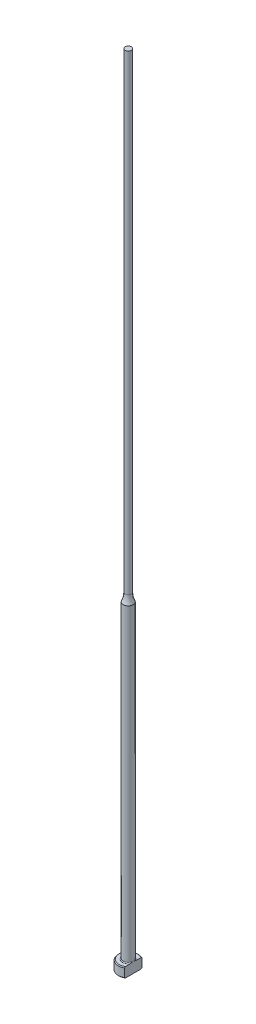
ISO-10303-21;
HEADER;
FILE_DESCRIPTION(('STEP AP214'),'2;1');
FILE_NAME('part.step','',(''),(''),'','','');
FILE_SCHEMA(('AUTOMOTIVE_DESIGN { 1 0 10303 214 1 1 1 1 }'));
ENDSEC;
DATA;
#1=APPLICATION_CONTEXT('core data for automotive mechanical design processes');
#2=APPLICATION_PROTOCOL_DEFINITION('international standard','automotive_design',2000,#1);
#3=PRODUCT_CONTEXT('',#1,'mechanical');
#4=PRODUCT('Part','Part','',(#3));
#5=PRODUCT_RELATED_PRODUCT_CATEGORY('part','',(#4));
#6=PRODUCT_DEFINITION_FORMATION('','',#4);
#7=PRODUCT_DEFINITION_CONTEXT('part definition',#1,'design');
#8=PRODUCT_DEFINITION('design','',#6,#7);
#9=PRODUCT_DEFINITION_SHAPE('','',#8);
#10=(LENGTH_UNIT() NAMED_UNIT(*) SI_UNIT(.MILLI.,.METRE.));
#11=(NAMED_UNIT(*) PLANE_ANGLE_UNIT() SI_UNIT($,.RADIAN.));
#12=(NAMED_UNIT(*) SI_UNIT($,.STERADIAN.) SOLID_ANGLE_UNIT());
#13=UNCERTAINTY_MEASURE_WITH_UNIT(LENGTH_MEASURE(1.E-05),#10,'distance_accuracy_value','');
#14=(GEOMETRIC_REPRESENTATION_CONTEXT(3) GLOBAL_UNCERTAINTY_ASSIGNED_CONTEXT((#13)) GLOBAL_UNIT_ASSIGNED_CONTEXT((#10,
#11,#12)) REPRESENTATION_CONTEXT('',''));
#15=CARTESIAN_POINT('',(0.,0.,0.));
#16=DIRECTION('',(0.,0.,1.));
#17=DIRECTION('',(1.,0.,0.));
#18=AXIS2_PLACEMENT_3D('',#15,#16,#17);
#19=CARTESIAN_POINT('',(-3.17499999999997,3.175,0.));
#20=DIRECTION('',(0.,1.,0.));
#21=DIRECTION('',(0.,0.,1.));
#22=AXIS2_PLACEMENT_3D('',#19,#20,#21);
#23=PLANE('',#22);
#24=CARTESIAN_POINT('',(0.,3.175,0.));
#25=DIRECTION('',(0.,1.,0.));
#26=DIRECTION('',(0.,0.,1.));
#27=AXIS2_PLACEMENT_3D('',#24,#25,#26);
#28=CIRCLE('',#27,2.92099999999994);
#29=CARTESIAN_POINT('',(1.58749999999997,3.175,-2.45195529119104));
#30=VERTEX_POINT('',#29);
#31=CARTESIAN_POINT('',(1.58749999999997,3.175,2.45195529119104));
#32=VERTEX_POINT('',#31);
#33=EDGE_CURVE('E105',#30,#32,#28,.T.);
#34=ORIENTED_EDGE('',*,*,#33,.T.);
#35=DIRECTION('',(0.,0.,1.));
#36=VECTOR('',#35,1.);
#37=CARTESIAN_POINT('',(1.58749999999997,3.17499999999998,2.74963065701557));
#38=LINE('',#37,#36);
#39=CARTESIAN_POINT('',(1.58749999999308,3.175,0.933255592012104));
#40=VERTEX_POINT('',#39);
#41=EDGE_CURVE('E126',#40,#32,#38,.T.);
#42=ORIENTED_EDGE('',*,*,#41,.F.);
#43=CARTESIAN_POINT('',(0.,3.175,0.));
#44=DIRECTION('',(0.,1.,0.));
#45=DIRECTION('',(0.,0.,1.));
#46=AXIS2_PLACEMENT_3D('',#43,#44,#45);
#47=CIRCLE('',#46,1.84149999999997);
#48=CARTESIAN_POINT('',(1.58749999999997,3.17500000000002,-0.933255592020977));
#49=VERTEX_POINT('',#48);
#50=EDGE_CURVE('E11',#40,#49,#47,.F.);
#51=ORIENTED_EDGE('',*,*,#50,.T.);
#52=EDGE_CURVE('E52',#30,#49,#38,.T.);
#53=ORIENTED_EDGE('',*,*,#52,.F.);
#54=EDGE_LOOP('',(#34,#42,#51,#53));
#55=FACE_BOUND('',#54,.T.);
#56=ADVANCED_FACE('F32',(#55),#23,.T.);
#57=CARTESIAN_POINT('',(0.,259.958771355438,0.));
#58=DIRECTION('',(0.,1.,0.));
#59=DIRECTION('',(0.,0.,1.));
#60=AXIS2_PLACEMENT_3D('',#57,#58,#59);
#61=CYLINDRICAL_SURFACE('',#60,3.17499999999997);
#62=CARTESIAN_POINT('',(0.,2.92100000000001,0.));
#63=DIRECTION('',(0.,1.,0.));
#64=DIRECTION('',(0.,0.,1.));
#65=AXIS2_PLACEMENT_3D('',#62,#63,#64);
#66=CIRCLE('',#65,3.17499999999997);
#67=CARTESIAN_POINT('',(1.58749999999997,2.92100000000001,2.74963065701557));
#68=VERTEX_POINT('',#67);
#69=CARTESIAN_POINT('',(1.58749999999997,2.92100000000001,-2.74963065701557));
#70=VERTEX_POINT('',#69);
#71=EDGE_CURVE('E98',#68,#70,#66,.F.);
#72=ORIENTED_EDGE('',*,*,#71,.T.);
#73=DIRECTION('',(0.,-1.,0.));
#74=VECTOR('',#73,1.);
#75=CARTESIAN_POINT('',(1.58749999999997,254.001,-2.74963065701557));
#76=LINE('',#75,#74);
#77=CARTESIAN_POINT('',(1.58749999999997,0.253999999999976,-2.74963065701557));
#78=VERTEX_POINT('',#77);
#79=EDGE_CURVE('E141',#70,#78,#76,.T.);
#80=ORIENTED_EDGE('',*,*,#79,.T.);
#81=CARTESIAN_POINT('',(0.,0.253999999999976,0.));
#82=DIRECTION('',(0.,-1.,0.));
#83=DIRECTION('',(0.,0.,-1.));
#84=AXIS2_PLACEMENT_3D('',#81,#82,#83);
#85=CIRCLE('',#84,3.17499999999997);
#86=CARTESIAN_POINT('',(1.58749999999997,0.253999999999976,2.74963065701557));
#87=VERTEX_POINT('',#86);
#88=EDGE_CURVE('E95',#78,#87,#85,.F.);
#89=ORIENTED_EDGE('',*,*,#88,.T.);
#90=DIRECTION('',(0.,-1.,0.));
#91=VECTOR('',#90,1.);
#92=CARTESIAN_POINT('',(1.58749999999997,254.001,2.74963065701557));
#93=LINE('',#92,#91);
#94=EDGE_CURVE('E88',#68,#87,#93,.T.);
#95=ORIENTED_EDGE('',*,*,#94,.F.);
#96=EDGE_LOOP('',(#72,#80,#89,#95));
#97=FACE_BOUND('',#96,.T.);
#98=ADVANCED_FACE('F191',(#97),#61,.T.);
#99=CARTESIAN_POINT('',(0.,0.,0.));
#100=DIRECTION('',(0.,-1.,0.));
#101=DIRECTION('',(0.,0.,-1.));
#102=AXIS2_PLACEMENT_3D('',#99,#100,#101);
#103=PLANE('',#102);
#104=CARTESIAN_POINT('',(0.,0.,0.));
#105=DIRECTION('',(0.,-1.,0.));
#106=DIRECTION('',(0.,0.,-1.));
#107=AXIS2_PLACEMENT_3D('',#104,#105,#106);
#108=CIRCLE('',#107,2.92100000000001);
#109=CARTESIAN_POINT('',(1.58749999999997,0.,2.45195529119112));
#110=VERTEX_POINT('',#109);
#111=CARTESIAN_POINT('',(1.58749999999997,0.,-2.45195529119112));
#112=VERTEX_POINT('',#111);
#113=EDGE_CURVE('E93',#110,#112,#108,.T.);
#114=ORIENTED_EDGE('',*,*,#113,.T.);
#115=DIRECTION('',(0.,0.,1.));
#116=VECTOR('',#115,1.);
#117=CARTESIAN_POINT('',(1.58749999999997,0.,2.74963065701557));
#118=LINE('',#117,#116);
#119=EDGE_CURVE('E78',#112,#110,#118,.T.);
#120=ORIENTED_EDGE('',*,*,#119,.T.);
#121=EDGE_LOOP('',(#114,#120));
#122=FACE_BOUND('',#121,.T.);
#123=ADVANCED_FACE('F97',(#122),#103,.T.);
#124=CARTESIAN_POINT('',(0.,3.17499999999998,0.));
#125=DIRECTION('',(0.,-1.,0.));
#126=DIRECTION('',(0.,0.,-1.));
#127=AXIS2_PLACEMENT_3D('',#124,#125,#126);
#128=CONICAL_SURFACE('',#127,2.92099999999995,0.785398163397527);
#129=ORIENTED_EDGE('',*,*,#71,.F.);
#130=CARTESIAN_POINT('',(1.58749999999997,-0.16162066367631,-6.0529050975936));
#131=CARTESIAN_POINT('',(1.58749999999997,-0.0288893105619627,-5.91567682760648));
#132=CARTESIAN_POINT('',(1.58749999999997,0.103699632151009,-5.7783103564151));
#133=CARTESIAN_POINT('',(1.58749999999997,0.368508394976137,-5.50321874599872));
#134=CARTESIAN_POINT('',(1.58749999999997,0.500728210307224,-5.36549360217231));
#135=CARTESIAN_POINT('',(1.58749999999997,0.764778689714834,-5.08953516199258));
#136=CARTESIAN_POINT('',(1.58749999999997,0.896609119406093,-4.9513016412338));
#137=CARTESIAN_POINT('',(1.58749999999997,1.15968706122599,-4.67428233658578));
#138=CARTESIAN_POINT('',(1.58749999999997,1.29093457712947,-4.53549655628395));
#139=CARTESIAN_POINT('',(1.58749999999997,1.55007705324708,-4.25997724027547));
#140=CARTESIAN_POINT('',(1.58749999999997,1.67798684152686,-4.12325766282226));
#141=CARTESIAN_POINT('',(1.58749999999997,1.9328486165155,-3.84892898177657));
#142=CARTESIAN_POINT('',(1.58749999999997,2.05980060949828,-3.71131988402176));
#143=CARTESIAN_POINT('',(1.58749999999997,2.31237508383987,-3.43493978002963));
#144=CARTESIAN_POINT('',(1.58749999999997,2.43799784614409,-3.29616903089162));
#145=CARTESIAN_POINT('',(1.58749999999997,2.68741369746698,-3.01699558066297));
#146=CARTESIAN_POINT('',(1.58749999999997,2.81120686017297,-2.8765929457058));
#147=CARTESIAN_POINT('',(1.58749999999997,3.00875865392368,-2.64816703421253));
#148=CARTESIAN_POINT('',(1.58749999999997,3.08336151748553,-2.56087478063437));
#149=CARTESIAN_POINT('',(1.58749999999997,3.2312387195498,-2.38515423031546));
#150=CARTESIAN_POINT('',(1.58749999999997,3.30451292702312,-2.29672582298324));
#151=CARTESIAN_POINT('',(1.58749999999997,3.45004422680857,-2.1174740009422));
#152=CARTESIAN_POINT('',(1.58749999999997,3.5222823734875,-2.02663514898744));
#153=CARTESIAN_POINT('',(1.58749999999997,3.66423097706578,-1.8430252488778));
#154=CARTESIAN_POINT('',(1.58749999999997,3.73394203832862,-1.75025467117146));
#155=CARTESIAN_POINT('',(1.58749999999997,3.87080633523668,-1.5606747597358));
#156=CARTESIAN_POINT('',(1.58749999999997,3.93790459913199,-1.46382547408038));
#157=CARTESIAN_POINT('',(1.58749999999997,4.06669147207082,-1.26632594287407));
#158=CARTESIAN_POINT('',(1.58749999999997,4.1283726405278,-1.16567073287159));
#159=CARTESIAN_POINT('',(1.58749999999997,4.21402252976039,-1.01165766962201));
#160=CARTESIAN_POINT('',(1.58749999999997,4.24127929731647,-0.960142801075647));
#161=CARTESIAN_POINT('',(1.58749999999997,4.2930979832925,-0.855780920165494));
#162=CARTESIAN_POINT('',(1.58749999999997,4.31765941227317,-0.802933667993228));
#163=CARTESIAN_POINT('',(1.58749999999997,4.38614656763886,-0.642461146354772));
#164=CARTESIAN_POINT('',(1.58749999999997,4.42510149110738,-0.532518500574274));
#165=CARTESIAN_POINT('',(1.58749999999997,4.46726244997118,-0.367680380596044));
#166=CARTESIAN_POINT('',(1.58749999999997,4.47844427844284,-0.314802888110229));
#167=CARTESIAN_POINT('',(1.58749999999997,4.49576654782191,-0.208209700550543));
#168=CARTESIAN_POINT('',(1.58749999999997,4.50190743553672,-0.154494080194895));
#169=CARTESIAN_POINT('',(1.58749999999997,4.50871296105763,-0.0468792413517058));
#170=CARTESIAN_POINT('',(1.58749999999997,4.5093945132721,0.00701889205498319));
#171=CARTESIAN_POINT('',(1.58749999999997,4.50527679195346,0.114606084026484));
#172=CARTESIAN_POINT('',(1.58749999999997,4.50047706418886,0.168295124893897));
#173=CARTESIAN_POINT('',(1.58749999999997,4.48579689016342,0.27448544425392));
#174=CARTESIAN_POINT('',(1.58749999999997,4.47596081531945,0.32699298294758));
#175=CARTESIAN_POINT('',(1.58749999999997,4.45181809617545,0.430974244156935));
#176=CARTESIAN_POINT('',(1.58749999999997,4.4375096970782,0.482447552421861));
#177=CARTESIAN_POINT('',(1.58749999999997,4.40502489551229,0.584460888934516));
#178=CARTESIAN_POINT('',(1.58749999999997,4.386827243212,0.634994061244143));
#179=CARTESIAN_POINT('',(1.58749999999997,4.34729308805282,0.734789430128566));
#180=CARTESIAN_POINT('',(1.58749999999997,4.3259572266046,0.784051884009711));
#181=CARTESIAN_POINT('',(1.58749999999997,4.25791922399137,0.930549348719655));
#182=CARTESIAN_POINT('',(1.58749999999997,4.20736047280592,1.0259880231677));
#183=CARTESIAN_POINT('',(1.58749999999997,4.0995545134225,1.21304313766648));
#184=CARTESIAN_POINT('',(1.58749999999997,4.04229912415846,1.30465471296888));
#185=CARTESIAN_POINT('',(1.58749999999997,3.92308746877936,1.48526211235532));
#186=CARTESIAN_POINT('',(1.58749999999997,3.86111349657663,1.57424615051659));
#187=CARTESIAN_POINT('',(1.58749999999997,3.73408621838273,1.74990003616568));
#188=CARTESIAN_POINT('',(1.58749999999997,3.66903444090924,1.83657099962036));
#189=CARTESIAN_POINT('',(1.58749999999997,3.53583371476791,2.00931764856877));
#190=CARTESIAN_POINT('',(1.58749999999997,3.46765527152,2.09537048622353));
#191=CARTESIAN_POINT('',(1.58749999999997,3.32960643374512,2.26611736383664));
#192=CARTESIAN_POINT('',(1.58749999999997,3.25973586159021,2.35081125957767));
#193=CARTESIAN_POINT('',(1.58749999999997,3.04858139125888,2.60290121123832));
#194=CARTESIAN_POINT('',(1.58749999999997,2.90542388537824,2.76872537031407));
#195=CARTESIAN_POINT('',(1.58749999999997,2.64069522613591,3.06970913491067));
#196=CARTESIAN_POINT('',(1.58749999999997,2.51959458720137,3.20528660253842));
#197=CARTESIAN_POINT('',(1.58749999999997,2.27590400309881,3.47510321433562));
#198=CARTESIAN_POINT('',(1.58749999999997,2.15331401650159,3.60934232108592));
#199=CARTESIAN_POINT('',(1.58749999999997,1.90694239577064,3.87695374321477));
#200=CARTESIAN_POINT('',(1.58749999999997,1.78315974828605,4.0103251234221));
#201=CARTESIAN_POINT('',(1.58749999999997,1.53478104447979,4.27630880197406));
#202=CARTESIAN_POINT('',(1.58749999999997,1.41018498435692,4.40892109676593));
#203=CARTESIAN_POINT('',(1.58749999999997,1.0457468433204,4.79499418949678));
#204=CARTESIAN_POINT('',(1.58749999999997,0.80507680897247,5.04767313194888));
#205=CARTESIAN_POINT('',(1.58749999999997,0.443121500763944,5.42550911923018));
#206=CARTESIAN_POINT('',(1.58749999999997,0.322378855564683,5.55118772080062));
#207=CARTESIAN_POINT('',(1.58749999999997,0.0805914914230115,5.80225207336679));
#208=CARTESIAN_POINT('',(1.58749999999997,-0.040453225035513,5.92763782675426));
#209=CARTESIAN_POINT('',(1.58749999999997,-0.161620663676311,6.0529050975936));
#210=B_SPLINE_CURVE_WITH_KNOTS('',3,(#130,#131,#132,#133,#134,#135,#136,#137,#138,#139,#140,
#141,#142,#143,#144,#145,#146,#147,#148,#149,#150,#151,#152,#153,#154,#155,#156,#157,#158,#159,
#160,#161,#162,#163,#164,#165,#166,#167,#168,#169,#170,#171,#172,#173,#174,#175,#176,#177,#178,
#179,#180,#181,#182,#183,#184,#185,#186,#187,#188,#189,#190,#191,#192,#193,#194,#195,#196,#197,
#198,#199,#200,#201,#202,#203,#204,#205,#206,#207,#208,#209),.UNSPECIFIED.,.F.,.F.,(4,2,2,2,2,2,
2,2,2,2,2,2,2,2,2,2,2,2,2,2,2,2,2,2,2,2,2,2,2,2,2,2,2,2,2,2,2,2,2,4),(0.,0.572750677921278,
1.14550874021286,1.71856057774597,2.29160869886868,2.85328006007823,3.4149477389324,
3.97649423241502,4.53801804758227,4.88249307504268,5.22700189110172,5.5751532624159,
5.92322081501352,6.27657800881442,6.63041319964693,6.80518126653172,6.9799810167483,
7.3282426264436,7.49018491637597,7.65211285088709,7.81353889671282,7.97497832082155,
8.13501929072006,8.29512313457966,8.45612518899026,8.61709438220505,8.94062993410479,
9.2645649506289,9.58978187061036,9.91483894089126,10.2441741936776,10.5735441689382,
11.2306812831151,11.7760337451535,12.3214014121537,12.8672825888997,13.4131663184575,
14.4600164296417,14.9828595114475,15.5056983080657),.UNSPECIFIED.);
#211=EDGE_CURVE('E118',#32,#68,#210,.T.);
#212=ORIENTED_EDGE('',*,*,#211,.F.);
#213=ORIENTED_EDGE('',*,*,#33,.F.);
#214=EDGE_CURVE('E117',#70,#30,#210,.T.);
#215=ORIENTED_EDGE('',*,*,#214,.F.);
#216=EDGE_LOOP('',(#129,#212,#213,#215));
#217=FACE_BOUND('',#216,.T.);
#218=ADVANCED_FACE('F162',(#217),#128,.T.);
#219=CARTESIAN_POINT('',(0.,0.253999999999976,0.));
#220=DIRECTION('',(0.,1.,0.));
#221=DIRECTION('',(0.,0.,1.));
#222=AXIS2_PLACEMENT_3D('',#219,#220,#221);
#223=CONICAL_SURFACE('',#222,3.17499999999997,0.785398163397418);
#224=ORIENTED_EDGE('',*,*,#88,.F.);
#225=CARTESIAN_POINT('',(1.58749999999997,3.33662066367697,6.0529050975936));
#226=CARTESIAN_POINT('',(1.58749999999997,3.20388931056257,5.91567682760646));
#227=CARTESIAN_POINT('',(1.58749999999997,3.07130036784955,5.77831035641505));
#228=CARTESIAN_POINT('',(1.58749999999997,2.80649160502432,5.50321874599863));
#229=CARTESIAN_POINT('',(1.58749999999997,2.67427178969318,5.3654936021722));
#230=CARTESIAN_POINT('',(1.58749999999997,2.41022131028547,5.08953516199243));
#231=CARTESIAN_POINT('',(1.58749999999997,2.27839088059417,4.95130164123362));
#232=CARTESIAN_POINT('',(1.58749999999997,2.01531293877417,4.67428233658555));
#233=CARTESIAN_POINT('',(1.58749999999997,1.88406542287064,4.5354965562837));
#234=CARTESIAN_POINT('',(1.58749999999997,1.62492294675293,4.25997724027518));
#235=CARTESIAN_POINT('',(1.58749999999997,1.49701315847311,4.12325766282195));
#236=CARTESIAN_POINT('',(1.58749999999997,1.24215138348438,3.84892898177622));
#237=CARTESIAN_POINT('',(1.58749999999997,1.11519939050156,3.71131988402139));
#238=CARTESIAN_POINT('',(1.58749999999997,0.862624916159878,3.43493978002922));
#239=CARTESIAN_POINT('',(1.58749999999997,0.737002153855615,3.29616903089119));
#240=CARTESIAN_POINT('',(1.58749999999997,0.487586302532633,3.01699558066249));
#241=CARTESIAN_POINT('',(1.58749999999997,0.363793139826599,2.8765929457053));
#242=CARTESIAN_POINT('',(1.58749999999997,0.166241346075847,2.64816703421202));
#243=CARTESIAN_POINT('',(1.58749999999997,0.0916384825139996,2.56087478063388));
#244=CARTESIAN_POINT('',(1.58749999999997,-0.0562387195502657,2.385154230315));
#245=CARTESIAN_POINT('',(1.58749999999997,-0.129512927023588,2.29672582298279));
#246=CARTESIAN_POINT('',(1.58749999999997,-0.27504422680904,2.11747400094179));
#247=CARTESIAN_POINT('',(1.58749999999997,-0.347282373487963,2.02663514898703));
#248=CARTESIAN_POINT('',(1.58749999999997,-0.489230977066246,1.84302524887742));
#249=CARTESIAN_POINT('',(1.58749999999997,-0.558942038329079,1.7502546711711));
#250=CARTESIAN_POINT('',(1.58749999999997,-0.695806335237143,1.56067475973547));
#251=CARTESIAN_POINT('',(1.58749999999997,-0.762904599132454,1.46382547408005));
#252=CARTESIAN_POINT('',(1.58749999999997,-0.891691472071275,1.26632594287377));
#253=CARTESIAN_POINT('',(1.58749999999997,-0.953372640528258,1.16567073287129));
#254=CARTESIAN_POINT('',(1.58749999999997,-1.03902252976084,1.01165766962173));
#255=CARTESIAN_POINT('',(1.58749999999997,-1.06627929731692,0.960142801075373));
#256=CARTESIAN_POINT('',(1.58749999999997,-1.11809798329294,0.85578092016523));
#257=CARTESIAN_POINT('',(1.58749999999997,-1.14265941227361,0.802933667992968));
#258=CARTESIAN_POINT('',(1.58749999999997,-1.21114656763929,0.642461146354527));
#259=CARTESIAN_POINT('',(1.58749999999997,-1.2501014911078,0.532518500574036));
#260=CARTESIAN_POINT('',(1.58749999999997,-1.29226244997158,0.367680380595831));
#261=CARTESIAN_POINT('',(1.58749999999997,-1.30344427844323,0.314802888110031));
#262=CARTESIAN_POINT('',(1.58749999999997,-1.32076654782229,0.208209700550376));
#263=CARTESIAN_POINT('',(1.58749999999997,-1.3269074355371,0.154494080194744));
#264=CARTESIAN_POINT('',(1.58749999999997,-1.333712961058,0.0468792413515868));
#265=CARTESIAN_POINT('',(1.58749999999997,-1.33439451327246,-0.00701889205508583));
#266=CARTESIAN_POINT('',(1.58749999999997,-1.33027679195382,-0.114606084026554));
#267=CARTESIAN_POINT('',(1.58749999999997,-1.32547706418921,-0.168295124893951));
#268=CARTESIAN_POINT('',(1.58749999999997,-1.31079689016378,-0.274485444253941));
#269=CARTESIAN_POINT('',(1.58749999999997,-1.3009608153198,-0.326992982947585));
#270=CARTESIAN_POINT('',(1.58749999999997,-1.27681809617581,-0.430974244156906));
#271=CARTESIAN_POINT('',(1.58749999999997,-1.26250969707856,-0.482447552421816));
#272=CARTESIAN_POINT('',(1.58749999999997,-1.23002489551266,-0.584460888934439));
#273=CARTESIAN_POINT('',(1.58749999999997,-1.21182724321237,-0.634994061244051));
#274=CARTESIAN_POINT('',(1.58749999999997,-1.1722930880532,-0.734789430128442));
#275=CARTESIAN_POINT('',(1.58749999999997,-1.15095722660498,-0.784051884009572));
#276=CARTESIAN_POINT('',(1.58749999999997,-1.08291922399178,-0.93054934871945));
#277=CARTESIAN_POINT('',(1.58749999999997,-1.03236047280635,-1.02598802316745));
#278=CARTESIAN_POINT('',(1.58749999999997,-0.924554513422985,-1.21304313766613));
#279=CARTESIAN_POINT('',(1.58749999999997,-0.86729912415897,-1.30465471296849));
#280=CARTESIAN_POINT('',(1.58749999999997,-0.748087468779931,-1.48526211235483));
#281=CARTESIAN_POINT('',(1.58749999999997,-0.686113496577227,-1.57424615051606));
#282=CARTESIAN_POINT('',(1.58749999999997,-0.55908621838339,-1.74990003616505));
#283=CARTESIAN_POINT('',(1.58749999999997,-0.494034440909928,-1.83657099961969));
#284=CARTESIAN_POINT('',(1.58749999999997,-0.360833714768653,-2.00931764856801));
#285=CARTESIAN_POINT('',(1.58749999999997,-0.292655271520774,-2.09537048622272));
#286=CARTESIAN_POINT('',(1.58749999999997,-0.154606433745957,-2.26611736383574));
#287=CARTESIAN_POINT('',(1.58749999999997,-0.0847358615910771,-2.35081125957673));
#288=CARTESIAN_POINT('',(1.58749999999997,0.126418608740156,-2.60290121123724));
#289=CARTESIAN_POINT('',(1.58749999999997,0.269576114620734,-2.76872537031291));
#290=CARTESIAN_POINT('',(1.58749999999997,0.534304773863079,-3.06970913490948));
#291=CARTESIAN_POINT('',(1.58749999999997,0.655405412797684,-3.20528660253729));
#292=CARTESIAN_POINT('',(1.58749999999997,0.899095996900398,-3.47510321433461));
#293=CARTESIAN_POINT('',(1.58749999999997,1.02168598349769,-3.60934232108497));
#294=CARTESIAN_POINT('',(1.58749999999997,1.26805760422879,-3.87695374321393));
#295=CARTESIAN_POINT('',(1.58749999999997,1.39184025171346,-4.01032512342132));
#296=CARTESIAN_POINT('',(1.58749999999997,1.64021895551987,-4.2763088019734));
#297=CARTESIAN_POINT('',(1.58749999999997,1.76481501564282,-4.40892109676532));
#298=CARTESIAN_POINT('',(1.58749999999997,2.12925315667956,-4.79499418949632));
#299=CARTESIAN_POINT('',(1.58749999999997,2.36992319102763,-5.04767313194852));
#300=CARTESIAN_POINT('',(1.58749999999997,2.73187849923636,-5.42550911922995));
#301=CARTESIAN_POINT('',(1.58749999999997,2.85262114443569,-5.55118772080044));
#302=CARTESIAN_POINT('',(1.58749999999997,3.09440850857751,-5.8022520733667));
#303=CARTESIAN_POINT('',(1.58749999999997,3.2154532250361,-5.92763782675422));
#304=CARTESIAN_POINT('',(1.58749999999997,3.33662066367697,-6.0529050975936));
#305=B_SPLINE_CURVE_WITH_KNOTS('',3,(#225,#226,#227,#228,#229,#230,#231,#232,#233,#234,#235,
#236,#237,#238,#239,#240,#241,#242,#243,#244,#245,#246,#247,#248,#249,#250,#251,#252,#253,#254,
#255,#256,#257,#258,#259,#260,#261,#262,#263,#264,#265,#266,#267,#268,#269,#270,#271,#272,#273,
#274,#275,#276,#277,#278,#279,#280,#281,#282,#283,#284,#285,#286,#287,#288,#289,#290,#291,#292,
#293,#294,#295,#296,#297,#298,#299,#300,#301,#302,#303,#304),.UNSPECIFIED.,.F.,.F.,(4,2,2,2,2,2,
2,2,2,2,2,2,2,2,2,2,2,2,2,2,2,2,2,2,2,2,2,2,2,2,2,2,2,2,2,2,2,2,2,4),(0.,0.57275067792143,
1.14550874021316,1.71856057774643,2.29160869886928,2.85328006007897,3.41494773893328,
3.97649423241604,4.53801804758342,4.88249307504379,5.2270018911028,5.57515326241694,
5.92322081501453,6.27657800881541,6.63041319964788,6.80518126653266,6.97998101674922,
7.32824262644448,7.49018491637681,7.65211285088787,7.81353889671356,7.97497832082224,
8.1350192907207,8.29512313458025,8.45612518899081,8.61709438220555,8.94062993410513,
9.26456495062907,9.58978187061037,9.91483894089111,10.2441741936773,10.5735441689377,
11.2306812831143,11.776033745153,12.3214014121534,12.8672825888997,13.4131663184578,
14.4600164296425,14.9828595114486,15.505698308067),.UNSPECIFIED.);
#306=EDGE_CURVE('E81',#112,#78,#305,.T.);
#307=ORIENTED_EDGE('',*,*,#306,.F.);
#308=ORIENTED_EDGE('',*,*,#113,.F.);
#309=EDGE_CURVE('E84',#87,#110,#305,.T.);
#310=ORIENTED_EDGE('',*,*,#309,.F.);
#311=EDGE_LOOP('',(#224,#307,#308,#310));
#312=FACE_BOUND('',#311,.T.);
#313=ADVANCED_FACE('F92',(#312),#223,.T.);
#314=CARTESIAN_POINT('',(0.,3.42900000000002,0.));
#315=DIRECTION('',(0.,1.,0.));
#316=DIRECTION('',(0.,0.,1.));
#317=AXIS2_PLACEMENT_3D('',#314,#315,#316);
#318=TOROIDAL_SURFACE('',#317,1.84149999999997,0.254);
#319=CARTESIAN_POINT('',(1.58749999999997,3.42900000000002,0.));
#320=CARTESIAN_POINT('',(1.58749999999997,3.42899942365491,-1.9220514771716E-10));
#321=CARTESIAN_POINT('',(1.58749999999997,3.42899884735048,-1.2261161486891E-07));
#322=CARTESIAN_POINT('',(1.58749999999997,3.42899773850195,-5.09676365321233E-07));
#323=CARTESIAN_POINT('',(1.58749999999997,3.42899720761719,-7.78176328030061E-07));
#324=CARTESIAN_POINT('',(1.58749999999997,3.42899614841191,-1.42307272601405E-06));
#325=CARTESIAN_POINT('',(1.58749999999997,3.42899562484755,-1.80713867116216E-06));
#326=CARTESIAN_POINT('',(1.58749999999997,3.42899463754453,-2.63494846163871E-06));
#327=CARTESIAN_POINT('',(1.58749999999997,3.42899417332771,-3.07814756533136E-06));
#328=CARTESIAN_POINT('',(1.58749999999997,3.42899261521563,-4.66897357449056E-06));
#329=CARTESIAN_POINT('',(1.58749999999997,3.42899159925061,-5.89404908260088E-06));
#330=CARTESIAN_POINT('',(1.58749999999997,3.42898979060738,-8.42427511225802E-06));
#331=CARTESIAN_POINT('',(1.58749999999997,3.42898899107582,-9.7248057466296E-06));
#332=CARTESIAN_POINT('',(1.58749999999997,3.42898598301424,-1.48060601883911E-05));
#333=CARTESIAN_POINT('',(1.58749999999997,3.42898393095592,-1.86838281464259E-05));
#334=CARTESIAN_POINT('',(1.58749999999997,3.42898057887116,-2.63261117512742E-05));
#335=CARTESIAN_POINT('',(1.58749999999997,3.42897922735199,-3.00687417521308E-05));
#336=CARTESIAN_POINT('',(1.58749999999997,3.42897347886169,-4.60276298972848E-05));
#337=CARTESIAN_POINT('',(1.58749999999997,3.42896911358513,-5.8247019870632E-05));
#338=CARTESIAN_POINT('',(1.58749999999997,3.42896211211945,-8.11070097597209E-05));
#339=CARTESIAN_POINT('',(1.58749999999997,3.42895931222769,-9.16953114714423E-05));
#340=CARTESIAN_POINT('',(1.58749999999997,3.42893712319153,-0.000168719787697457));
#341=CARTESIAN_POINT('',(1.58749999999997,3.42890881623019,-0.000232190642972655));
#342=CARTESIAN_POINT('',(1.58749999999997,3.42880276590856,-0.000479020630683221));
#343=CARTESIAN_POINT('',(1.58749999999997,3.42873165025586,-0.00066443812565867));
#344=CARTESIAN_POINT('',(1.58749999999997,3.42845137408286,-0.0013844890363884));
#345=CARTESIAN_POINT('',(1.58749999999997,3.42823526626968,-0.00191701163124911));
#346=CARTESIAN_POINT('',(1.58749999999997,3.42735449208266,-0.00409774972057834));
#347=CARTESIAN_POINT('',(1.58749999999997,3.42669768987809,-0.00574830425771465));
#348=CARTESIAN_POINT('',(1.58749999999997,3.4174405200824,-0.0289985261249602));
#349=CARTESIAN_POINT('',(1.58749999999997,3.40878325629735,-0.0505816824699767));
#350=CARTESIAN_POINT('',(1.58749999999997,3.39189297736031,-0.0929947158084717));
#351=CARTESIAN_POINT('',(1.58749999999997,3.38365605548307,-0.11382315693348));
#352=CARTESIAN_POINT('',(1.58749999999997,3.36635393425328,-0.157956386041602));
#353=CARTESIAN_POINT('',(1.58749999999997,3.35730391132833,-0.181267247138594));
#354=CARTESIAN_POINT('',(1.58749999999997,3.33936775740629,-0.228222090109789));
#355=CARTESIAN_POINT('',(1.58749999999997,3.33048420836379,-0.25186705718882));
#356=CARTESIAN_POINT('',(1.58749999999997,3.30894496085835,-0.310512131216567));
#357=CARTESIAN_POINT('',(1.58749999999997,3.29649449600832,-0.345588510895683));
#358=CARTESIAN_POINT('',(1.58749999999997,3.27296975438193,-0.415278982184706));
#359=CARTESIAN_POINT('',(1.58749999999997,3.26186987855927,-0.449884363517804));
#360=CARTESIAN_POINT('',(1.58749999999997,3.2395832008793,-0.524471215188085));
#361=CARTESIAN_POINT('',(1.58749999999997,3.22860862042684,-0.564517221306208));
#362=CARTESIAN_POINT('',(1.58749999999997,3.20902534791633,-0.645529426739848));
#363=CARTESIAN_POINT('',(1.58749999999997,3.20043582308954,-0.686500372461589));
#364=CARTESIAN_POINT('',(1.58749999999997,3.18611712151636,-0.771546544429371));
#365=CARTESIAN_POINT('',(1.58749999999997,3.18059550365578,-0.815658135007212));
#366=CARTESIAN_POINT('',(1.58749999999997,3.17455396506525,-0.904117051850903));
#367=CARTESIAN_POINT('',(1.58749999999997,3.17401361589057,-0.948462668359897));
#368=CARTESIAN_POINT('',(1.58749999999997,3.17898948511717,-1.02531896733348));
#369=CARTESIAN_POINT('',(1.58749999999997,3.1829739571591,-1.05792141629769));
#370=CARTESIAN_POINT('',(1.58749999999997,3.19569167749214,-1.12184393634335));
#371=CARTESIAN_POINT('',(1.58749999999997,3.20436049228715,-1.1531753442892));
#372=CARTESIAN_POINT('',(1.58749999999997,3.22236152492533,-1.19946468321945));
#373=CARTESIAN_POINT('',(1.58749999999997,3.2295150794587,-1.21526783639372));
#374=CARTESIAN_POINT('',(1.58749999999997,3.24587062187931,-1.24583726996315));
#375=CARTESIAN_POINT('',(1.58749999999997,3.25507530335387,-1.26060215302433));
#376=CARTESIAN_POINT('',(1.58749999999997,3.27378481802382,-1.28575815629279));
#377=CARTESIAN_POINT('',(1.58749999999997,3.28289001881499,-1.29644383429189));
#378=CARTESIAN_POINT('',(1.58749999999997,3.30268460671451,-1.31623154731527));
#379=CARTESIAN_POINT('',(1.58749999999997,3.31337067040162,-1.32533681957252));
#380=CARTESIAN_POINT('',(1.58749999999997,3.33349977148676,-1.33941140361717));
#381=CARTESIAN_POINT('',(1.58749999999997,3.34261446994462,-1.34484814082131));
#382=CARTESIAN_POINT('',(1.58749999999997,3.36161455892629,-1.35416329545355));
#383=CARTESIAN_POINT('',(1.58749999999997,3.37149946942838,-1.35804267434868));
#384=CARTESIAN_POINT('',(1.58749999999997,3.39188678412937,-1.36398436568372));
#385=CARTESIAN_POINT('',(1.58749999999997,3.40239309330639,-1.36603350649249));
#386=CARTESIAN_POINT('',(1.58749999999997,3.42360372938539,-1.3680840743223));
#387=CARTESIAN_POINT('',(1.58749999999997,3.43430795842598,-1.36808648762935));
#388=CARTESIAN_POINT('',(1.58749999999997,3.45433283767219,-1.36616208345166));
#389=CARTESIAN_POINT('',(1.58749999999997,3.46367506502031,-1.36444960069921));
#390=CARTESIAN_POINT('',(1.58749999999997,3.48195519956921,-1.35953338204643));
#391=CARTESIAN_POINT('',(1.58749999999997,3.49089304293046,-1.3563294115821));
#392=CARTESIAN_POINT('',(1.58749999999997,3.50850302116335,-1.34848006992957));
#393=CARTESIAN_POINT('',(1.58749999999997,3.5171531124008,-1.34378578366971));
#394=CARTESIAN_POINT('',(1.58749999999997,3.53371257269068,-1.33324445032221));
#395=CARTESIAN_POINT('',(1.58749999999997,3.54162163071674,-1.32739692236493));
#396=CARTESIAN_POINT('',(1.58749999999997,3.56107121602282,-1.31107304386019));
#397=CARTESIAN_POINT('',(1.58749999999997,3.57202221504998,-1.29989286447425));
#398=CARTESIAN_POINT('',(1.58749999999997,3.59202509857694,-1.27593566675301));
#399=CARTESIAN_POINT('',(1.58749999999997,3.60107086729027,-1.26315370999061));
#400=CARTESIAN_POINT('',(1.58749999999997,3.62186023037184,-1.22930733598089));
#401=CARTESIAN_POINT('',(1.58749999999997,3.63240584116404,-1.20751096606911));
#402=CARTESIAN_POINT('',(1.58749999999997,3.65004643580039,-1.16266144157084));
#403=CARTESIAN_POINT('',(1.58749999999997,3.65714435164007,-1.13960937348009));
#404=CARTESIAN_POINT('',(1.58749999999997,3.67265428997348,-1.07603916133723));
#405=CARTESIAN_POINT('',(1.58749999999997,3.67834921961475,-1.03486686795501));
#406=CARTESIAN_POINT('',(1.58749999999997,3.68382880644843,-0.951558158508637));
#407=CARTESIAN_POINT('',(1.58749999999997,3.68350976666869,-0.909417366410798));
#408=CARTESIAN_POINT('',(1.58749999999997,3.67745397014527,-0.811383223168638));
#409=CARTESIAN_POINT('',(1.58749999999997,3.66993873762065,-0.755610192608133));
#410=CARTESIAN_POINT('',(1.58749999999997,3.64933373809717,-0.644937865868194));
#411=CARTESIAN_POINT('',(1.58749999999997,3.63621897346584,-0.59004364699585));
#412=CARTESIAN_POINT('',(1.58749999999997,3.60740922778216,-0.485757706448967));
#413=CARTESIAN_POINT('',(1.58749999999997,3.59201096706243,-0.436281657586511));
#414=CARTESIAN_POINT('',(1.58749999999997,3.55922497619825,-0.338551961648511));
#415=CARTESIAN_POINT('',(1.58749999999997,3.5418584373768,-0.290291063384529));
#416=CARTESIAN_POINT('',(1.58749999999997,3.51760237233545,-0.225557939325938));
#417=CARTESIAN_POINT('',(1.58749999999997,3.51126413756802,-0.208874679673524));
#418=CARTESIAN_POINT('',(1.58749999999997,3.49830042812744,-0.17512392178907));
#419=CARTESIAN_POINT('',(1.58749999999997,3.49167176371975,-0.158057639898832));
#420=CARTESIAN_POINT('',(1.58749999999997,3.47585523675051,-0.117638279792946));
#421=CARTESIAN_POINT('',(1.58749999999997,3.46662970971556,-0.0943002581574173));
#422=CARTESIAN_POINT('',(1.58749999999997,3.44889695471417,-0.0497824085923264));
#423=CARTESIAN_POINT('',(1.58749999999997,3.44040039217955,-0.028598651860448));
#424=CARTESIAN_POINT('',(1.58749999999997,3.43130364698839,-0.00575168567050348));
#425=CARTESIAN_POINT('',(1.58749999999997,3.43064818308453,-0.00410451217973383));
#426=CARTESIAN_POINT('',(1.58749999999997,3.42976776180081,-0.00192459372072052));
#427=CARTESIAN_POINT('',(1.58749999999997,3.42955062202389,-0.00138952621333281));
#428=CARTESIAN_POINT('',(1.58749999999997,3.42926908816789,-0.000666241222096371));
#429=CARTESIAN_POINT('',(1.58749999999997,3.42919771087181,-0.000480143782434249));
#430=CARTESIAN_POINT('',(1.58749999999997,3.42909131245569,-0.000232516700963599));
#431=CARTESIAN_POINT('',(1.58749999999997,3.42906294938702,-0.000168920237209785));
#432=CARTESIAN_POINT('',(1.58749999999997,3.42904072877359,-9.17527162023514E-05));
#433=CARTESIAN_POINT('',(1.58749999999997,3.42903792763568,-8.11550293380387E-05));
#434=CARTESIAN_POINT('',(1.58749999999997,3.42903091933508,-5.82743948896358E-05));
#435=CARTESIAN_POINT('',(1.58749999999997,3.42902654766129,-4.60440001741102E-05));
#436=CARTESIAN_POINT('',(1.58749999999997,3.42902079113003,-3.00727682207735E-05));
#437=CARTESIAN_POINT('',(1.58749999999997,3.42901943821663,-2.63286807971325E-05));
#438=CARTESIAN_POINT('',(1.58749999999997,3.42901608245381,-1.86836529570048E-05));
#439=CARTESIAN_POINT('',(1.58749999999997,3.4290140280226,-1.48046517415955E-05));
#440=CARTESIAN_POINT('',(1.58749999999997,3.42901101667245,-9.72223943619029E-06));
#441=CARTESIAN_POINT('',(1.58749999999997,3.42901021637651,-8.42159649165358E-06));
#442=CARTESIAN_POINT('',(1.58749999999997,3.42900840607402,-5.89129729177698E-06));
#443=CARTESIAN_POINT('',(1.58749999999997,3.42900738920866,-4.66626867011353E-06));
#444=CARTESIAN_POINT('',(1.58749999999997,3.42900582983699,-3.07568803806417E-06));
#445=CARTESIAN_POINT('',(1.58749999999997,3.42900536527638,-2.63259565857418E-06));
#446=CARTESIAN_POINT('',(1.58749999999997,3.4290043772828,-1.80506085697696E-06));
#447=CARTESIAN_POINT('',(1.58749999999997,3.42900385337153,-1.42116387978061E-06));
#448=CARTESIAN_POINT('',(1.58749999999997,3.42900279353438,-7.76675643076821E-07));
#449=CARTESIAN_POINT('',(1.58749999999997,3.42900226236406,-5.08406487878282E-07));
#450=CARTESIAN_POINT('',(1.58749999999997,3.42900115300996,-1.21901887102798E-07));
#451=CARTESIAN_POINT('',(1.58749999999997,3.42900057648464,1.92251677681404E-10));
#452=CARTESIAN_POINT('',(1.58749999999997,3.42900000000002,0.));
#453=B_SPLINE_CURVE_WITH_KNOTS('',3,(#319,#320,#321,#322,#323,#324,#325,#326,#327,#328,#329,
#330,#331,#332,#333,#334,#335,#336,#337,#338,#339,#340,#341,#342,#343,#344,#345,#346,#347,#348,
#349,#350,#351,#352,#353,#354,#355,#356,#357,#358,#359,#360,#361,#362,#363,#364,#365,#366,#367,
#368,#369,#370,#371,#372,#373,#374,#375,#376,#377,#378,#379,#380,#381,#382,#383,#384,#385,#386,
#387,#388,#389,#390,#391,#392,#393,#394,#395,#396,#397,#398,#399,#400,#401,#402,#403,#404,#405,
#406,#407,#408,#409,#410,#411,#412,#413,#414,#415,#416,#417,#418,#419,#420,#421,#422,#423,#424,
#425,#426,#427,#428,#429,#430,#431,#432,#433,#434,#435,#436,#437,#438,#439,#440,#441,#442,#443,
#444,#445,#446,#447,#448,#449,#450,#451,#452),.UNSPECIFIED.,.T.,.F.,(4,2,2,2,2,2,2,2,2,2,2,2,2,
2,2,2,2,2,2,2,2,2,2,2,2,2,2,2,2,2,2,2,2,2,2,2,2,2,2,2,2,2,2,2,2,2,2,2,2,2,2,2,2,2,2,2,2,2,2,2,2,
2,2,2,2,2,4),(0.,1.72815458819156E-06,3.50429255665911E-06,5.44431004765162E-06,
7.3675525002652E-06,1.2119089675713E-05,1.66953775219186E-05,2.98160400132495E-05,
4.17409564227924E-05,8.0660475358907E-05,0.000113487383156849,0.000321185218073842,
0.000917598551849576,0.00264089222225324,0.00797105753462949,0.0777276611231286,
0.144923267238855,0.219939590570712,0.295714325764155,0.407362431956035,0.516367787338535,
0.640878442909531,0.766362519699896,0.899536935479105,1.03216495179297,1.13045740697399,
1.22743103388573,1.27935899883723,1.33135556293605,1.37333248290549,1.41522237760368,
1.44693946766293,1.47863694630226,1.51056074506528,1.54246916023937,1.57083210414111,
1.59919951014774,1.62861579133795,1.65804436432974,1.70472658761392,1.75155645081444,
1.82378709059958,1.89595619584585,2.01995471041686,2.1460932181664,2.31447224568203,
2.48361094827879,2.6389891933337,2.79283011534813,2.84637031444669,2.9012946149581,
2.97658236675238,3.04504771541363,3.05036697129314,3.05209849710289,3.05269709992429,
3.05290520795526,3.05293806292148,3.05297701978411,3.05298895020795,3.05300207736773,
3.05300665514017,3.0530114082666,3.05301333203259,3.05301527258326,3.05301704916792,
3.05301877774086),.UNSPECIFIED.);
#454=CARTESIAN_POINT('',(1.58749999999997,3.42900000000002,0.));
#455=VERTEX_POINT('',#454);
#456=EDGE_CURVE('E47',#455,#49,#453,.T.);
#457=ORIENTED_EDGE('',*,*,#456,.T.);
#458=ORIENTED_EDGE('',*,*,#50,.F.);
#459=CARTESIAN_POINT('',(1.58749999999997,3.42900000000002,0.));
#460=CARTESIAN_POINT('',(1.58749999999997,3.42900057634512,1.9220512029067E-10));
#461=CARTESIAN_POINT('',(1.58749999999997,3.42900115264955,1.22611614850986E-07));
#462=CARTESIAN_POINT('',(1.58749999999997,3.42900226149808,5.09676365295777E-07));
#463=CARTESIAN_POINT('',(1.58749999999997,3.42900279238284,7.78176328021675E-07));
#464=CARTESIAN_POINT('',(1.58749999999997,3.42900385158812,1.42307272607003E-06));
#465=CARTESIAN_POINT('',(1.58749999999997,3.42900437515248,1.80713867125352E-06));
#466=CARTESIAN_POINT('',(1.58749999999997,3.4290053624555,2.63494846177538E-06));
#467=CARTESIAN_POINT('',(1.58749999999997,3.42900582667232,3.0781475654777E-06));
#468=CARTESIAN_POINT('',(1.58749999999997,3.4290073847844,4.66897357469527E-06));
#469=CARTESIAN_POINT('',(1.58749999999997,3.42900840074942,5.89404908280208E-06));
#470=CARTESIAN_POINT('',(1.58749999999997,3.42901020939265,8.42427511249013E-06));
#471=CARTESIAN_POINT('',(1.58749999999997,3.42901100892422,9.72480574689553E-06));
#472=CARTESIAN_POINT('',(1.58749999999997,3.42901401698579,1.48060601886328E-05));
#473=CARTESIAN_POINT('',(1.58749999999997,3.42901606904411,1.86838281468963E-05));
#474=CARTESIAN_POINT('',(1.58749999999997,3.42901942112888,2.63261117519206E-05));
#475=CARTESIAN_POINT('',(1.58749999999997,3.42902077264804,3.00687417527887E-05));
#476=CARTESIAN_POINT('',(1.58749999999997,3.42902652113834,4.60276298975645E-05));
#477=CARTESIAN_POINT('',(1.58749999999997,3.4290308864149,5.82470198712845E-05));
#478=CARTESIAN_POINT('',(1.58749999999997,3.42903788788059,8.11070097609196E-05));
#479=CARTESIAN_POINT('',(1.58749999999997,3.42904068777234,9.16953114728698E-05));
#480=CARTESIAN_POINT('',(1.58749999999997,3.4290628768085,0.000168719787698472));
#481=CARTESIAN_POINT('',(1.58749999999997,3.42909118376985,0.000232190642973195));
#482=CARTESIAN_POINT('',(1.58749999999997,3.42919723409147,0.000479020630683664));
#483=CARTESIAN_POINT('',(1.58749999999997,3.42926834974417,0.000664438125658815));
#484=CARTESIAN_POINT('',(1.58749999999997,3.42954862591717,0.00138448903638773));
#485=CARTESIAN_POINT('',(1.58749999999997,3.42976473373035,0.00191701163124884));
#486=CARTESIAN_POINT('',(1.58749999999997,3.43064550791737,0.00409774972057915));
#487=CARTESIAN_POINT('',(1.58749999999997,3.43130231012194,0.00574830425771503));
#488=CARTESIAN_POINT('',(1.58749999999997,3.44055947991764,0.0289985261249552));
#489=CARTESIAN_POINT('',(1.58749999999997,3.44921674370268,0.0505816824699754));
#490=CARTESIAN_POINT('',(1.58749999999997,3.46610702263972,0.0929947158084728));
#491=CARTESIAN_POINT('',(1.58749999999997,3.47434394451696,0.11382315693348));
#492=CARTESIAN_POINT('',(1.58749999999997,3.49164606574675,0.157956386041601));
#493=CARTESIAN_POINT('',(1.58749999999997,3.5006960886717,0.181267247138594));
#494=CARTESIAN_POINT('',(1.58749999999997,3.51863224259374,0.228222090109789));
#495=CARTESIAN_POINT('',(1.58749999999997,3.52751579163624,0.25186705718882));
#496=CARTESIAN_POINT('',(1.58749999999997,3.54905503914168,0.310512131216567));
#497=CARTESIAN_POINT('',(1.58749999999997,3.56150550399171,0.345588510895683));
#498=CARTESIAN_POINT('',(1.58749999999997,3.5850302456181,0.415278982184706));
#499=CARTESIAN_POINT('',(1.58749999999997,3.59613012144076,0.449884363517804));
#500=CARTESIAN_POINT('',(1.58749999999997,3.61841679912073,0.524471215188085));
#501=CARTESIAN_POINT('',(1.58749999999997,3.62939137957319,0.564517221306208));
#502=CARTESIAN_POINT('',(1.58749999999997,3.6489746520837,0.645529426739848));
#503=CARTESIAN_POINT('',(1.58749999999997,3.65756417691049,0.686500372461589));
#504=CARTESIAN_POINT('',(1.58749999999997,3.67188287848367,0.771546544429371));
#505=CARTESIAN_POINT('',(1.58749999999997,3.67740449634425,0.815658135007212));
#506=CARTESIAN_POINT('',(1.58749999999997,3.68344603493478,0.904117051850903));
#507=CARTESIAN_POINT('',(1.58749999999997,3.68398638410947,0.948462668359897));
#508=CARTESIAN_POINT('',(1.58749999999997,3.67901051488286,1.02531896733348));
#509=CARTESIAN_POINT('',(1.58749999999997,3.67502604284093,1.05792141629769));
#510=CARTESIAN_POINT('',(1.58749999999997,3.66230832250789,1.12184393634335));
#511=CARTESIAN_POINT('',(1.58749999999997,3.65363950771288,1.1531753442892));
#512=CARTESIAN_POINT('',(1.58749999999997,3.6356384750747,1.19946468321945));
#513=CARTESIAN_POINT('',(1.58749999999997,3.62848492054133,1.21526783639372));
#514=CARTESIAN_POINT('',(1.58749999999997,3.61212937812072,1.24583726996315));
#515=CARTESIAN_POINT('',(1.58749999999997,3.60292469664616,1.26060215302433));
#516=CARTESIAN_POINT('',(1.58749999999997,3.58421518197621,1.28575815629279));
#517=CARTESIAN_POINT('',(1.58749999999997,3.57510998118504,1.29644383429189));
#518=CARTESIAN_POINT('',(1.58749999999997,3.55531539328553,1.31623154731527));
#519=CARTESIAN_POINT('',(1.58749999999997,3.54462932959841,1.32533681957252));
#520=CARTESIAN_POINT('',(1.58749999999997,3.52450022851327,1.33941140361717));
#521=CARTESIAN_POINT('',(1.58749999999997,3.51538553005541,1.34484814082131));
#522=CARTESIAN_POINT('',(1.58749999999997,3.49638544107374,1.35416329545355));
#523=CARTESIAN_POINT('',(1.58749999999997,3.48650053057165,1.35804267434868));
#524=CARTESIAN_POINT('',(1.58749999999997,3.46611321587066,1.36398436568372));
#525=CARTESIAN_POINT('',(1.58749999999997,3.45560690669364,1.36603350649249));
#526=CARTESIAN_POINT('',(1.58749999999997,3.43439627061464,1.3680840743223));
#527=CARTESIAN_POINT('',(1.58749999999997,3.42369204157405,1.36808648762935));
#528=CARTESIAN_POINT('',(1.58749999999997,3.40366716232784,1.36616208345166));
#529=CARTESIAN_POINT('',(1.58749999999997,3.39432493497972,1.36444960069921));
#530=CARTESIAN_POINT('',(1.58749999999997,3.37604480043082,1.35953338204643));
#531=CARTESIAN_POINT('',(1.58749999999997,3.36710695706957,1.3563294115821));
#532=CARTESIAN_POINT('',(1.58749999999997,3.34949697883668,1.34848006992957));
#533=CARTESIAN_POINT('',(1.58749999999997,3.34084688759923,1.34378578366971));
#534=CARTESIAN_POINT('',(1.58749999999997,3.32428742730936,1.33324445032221));
#535=CARTESIAN_POINT('',(1.58749999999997,3.31637836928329,1.32739692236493));
#536=CARTESIAN_POINT('',(1.58749999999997,3.29692878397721,1.31107304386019));
#537=CARTESIAN_POINT('',(1.58749999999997,3.28597778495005,1.29989286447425));
#538=CARTESIAN_POINT('',(1.58749999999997,3.26597490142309,1.27593566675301));
#539=CARTESIAN_POINT('',(1.58749999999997,3.25692913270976,1.26315370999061));
#540=CARTESIAN_POINT('',(1.58749999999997,3.23613976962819,1.22930733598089));
#541=CARTESIAN_POINT('',(1.58749999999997,3.22559415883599,1.20751096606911));
#542=CARTESIAN_POINT('',(1.58749999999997,3.20795356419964,1.16266144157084));
#543=CARTESIAN_POINT('',(1.58749999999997,3.20085564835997,1.13960937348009));
#544=CARTESIAN_POINT('',(1.58749999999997,3.18534571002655,1.07603916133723));
#545=CARTESIAN_POINT('',(1.58749999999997,3.17965078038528,1.03486686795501));
#546=CARTESIAN_POINT('',(1.58749999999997,3.1741711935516,0.951558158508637));
#547=CARTESIAN_POINT('',(1.58749999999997,3.17449023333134,0.909417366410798));
#548=CARTESIAN_POINT('',(1.58749999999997,3.18054602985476,0.811383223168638));
#549=CARTESIAN_POINT('',(1.58749999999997,3.18806126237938,0.755610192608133));
#550=CARTESIAN_POINT('',(1.58749999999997,3.20866626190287,0.644937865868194));
#551=CARTESIAN_POINT('',(1.58749999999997,3.2217810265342,0.59004364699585));
#552=CARTESIAN_POINT('',(1.58749999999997,3.25059077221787,0.485757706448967));
#553=CARTESIAN_POINT('',(1.58749999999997,3.2659890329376,0.43628165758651));
#554=CARTESIAN_POINT('',(1.58749999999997,3.29877502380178,0.338551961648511));
#555=CARTESIAN_POINT('',(1.58749999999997,3.31614156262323,0.290291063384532));
#556=CARTESIAN_POINT('',(1.58749999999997,3.34039762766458,0.225557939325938));
#557=CARTESIAN_POINT('',(1.58749999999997,3.346735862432,0.208874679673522));
#558=CARTESIAN_POINT('',(1.58749999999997,3.35969957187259,0.175123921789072));
#559=CARTESIAN_POINT('',(1.58749999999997,3.3663282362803,0.15805763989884));
#560=CARTESIAN_POINT('',(1.58749999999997,3.3821447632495,0.117638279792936));
#561=CARTESIAN_POINT('',(1.58749999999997,3.39137029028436,0.0943002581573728));
#562=CARTESIAN_POINT('',(1.58749999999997,3.40910304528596,0.0497824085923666));
#563=CARTESIAN_POINT('',(1.58749999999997,3.41759960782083,0.0285986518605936));
#564=CARTESIAN_POINT('',(1.58749999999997,3.42669635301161,0.00575168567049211));
#565=CARTESIAN_POINT('',(1.58749999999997,3.42735181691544,0.00410451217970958));
#566=CARTESIAN_POINT('',(1.58749999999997,3.42823223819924,0.00192459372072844));
#567=CARTESIAN_POINT('',(1.58749999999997,3.42844937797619,0.00138952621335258));
#568=CARTESIAN_POINT('',(1.58749999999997,3.42873091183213,0.000666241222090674));
#569=CARTESIAN_POINT('',(1.58749999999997,3.42880228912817,0.000480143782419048));
#570=CARTESIAN_POINT('',(1.58749999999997,3.42890868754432,0.000232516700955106));
#571=CARTESIAN_POINT('',(1.58749999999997,3.42893705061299,0.000168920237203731));
#572=CARTESIAN_POINT('',(1.58749999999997,3.42895927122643,9.17527161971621E-05));
#573=CARTESIAN_POINT('',(1.58749999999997,3.42896207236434,8.1155029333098E-05));
#574=CARTESIAN_POINT('',(1.58749999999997,3.42896908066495,5.82743948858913E-05));
#575=CARTESIAN_POINT('',(1.58749999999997,3.42897345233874,4.60440001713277E-05));
#576=CARTESIAN_POINT('',(1.58749999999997,3.42897920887,3.00727682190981E-05));
#577=CARTESIAN_POINT('',(1.58749999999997,3.42898056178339,2.63286807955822E-05));
#578=CARTESIAN_POINT('',(1.58749999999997,3.42898391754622,1.86836529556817E-05));
#579=CARTESIAN_POINT('',(1.58749999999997,3.42898597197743,1.48046517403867E-05));
#580=CARTESIAN_POINT('',(1.58749999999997,3.42898898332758,9.72223943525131E-06));
#581=CARTESIAN_POINT('',(1.58749999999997,3.42898978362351,8.42159649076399E-06));
#582=CARTESIAN_POINT('',(1.58749999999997,3.42899159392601,5.89129729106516E-06));
#583=CARTESIAN_POINT('',(1.58749999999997,3.42899261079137,4.66626866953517E-06));
#584=CARTESIAN_POINT('',(1.58749999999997,3.42899417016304,3.0756880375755E-06));
#585=CARTESIAN_POINT('',(1.58749999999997,3.42899463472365,2.63259565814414E-06));
#586=CARTESIAN_POINT('',(1.58749999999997,3.42899562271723,1.80506085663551E-06));
#587=CARTESIAN_POINT('',(1.58749999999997,3.42899614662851,1.42116387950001E-06));
#588=CARTESIAN_POINT('',(1.58749999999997,3.42899720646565,7.7667564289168E-07));
#589=CARTESIAN_POINT('',(1.58749999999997,3.42899773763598,5.0840648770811E-07));
#590=CARTESIAN_POINT('',(1.58749999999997,3.42899884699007,1.21901887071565E-07));
#591=CARTESIAN_POINT('',(1.58749999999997,3.42899942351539,-1.92251650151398E-10));
#592=CARTESIAN_POINT('',(1.58749999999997,3.42900000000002,0.));
#593=B_SPLINE_CURVE_WITH_KNOTS('',3,(#459,#460,#461,#462,#463,#464,#465,#466,#467,#468,#469,
#470,#471,#472,#473,#474,#475,#476,#477,#478,#479,#480,#481,#482,#483,#484,#485,#486,#487,#488,
#489,#490,#491,#492,#493,#494,#495,#496,#497,#498,#499,#500,#501,#502,#503,#504,#505,#506,#507,
#508,#509,#510,#511,#512,#513,#514,#515,#516,#517,#518,#519,#520,#521,#522,#523,#524,#525,#526,
#527,#528,#529,#530,#531,#532,#533,#534,#535,#536,#537,#538,#539,#540,#541,#542,#543,#544,#545,
#546,#547,#548,#549,#550,#551,#552,#553,#554,#555,#556,#557,#558,#559,#560,#561,#562,#563,#564,
#565,#566,#567,#568,#569,#570,#571,#572,#573,#574,#575,#576,#577,#578,#579,#580,#581,#582,#583,
#584,#585,#586,#587,#588,#589,#590,#591,#592),.UNSPECIFIED.,.T.,.F.,(4,2,2,2,2,2,2,2,2,2,2,2,2,
2,2,2,2,2,2,2,2,2,2,2,2,2,2,2,2,2,2,2,2,2,2,2,2,2,2,2,2,2,2,2,2,2,2,2,2,2,2,2,2,2,2,2,2,2,2,2,2,
2,2,2,2,2,4),(0.,1.72815458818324E-06,3.50429255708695E-06,5.44431004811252E-06,
7.36755250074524E-06,1.21190896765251E-05,1.66953775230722E-05,2.98160400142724E-05,
4.17409564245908E-05,8.06604753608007E-05,0.000113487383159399,0.000321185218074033,
0.000917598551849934,0.00264089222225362,0.00797105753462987,0.077727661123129,
0.144923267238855,0.219939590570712,0.295714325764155,0.407362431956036,0.516367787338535,
0.640878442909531,0.766362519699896,0.899536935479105,1.03216495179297,1.13045740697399,
1.22743103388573,1.27935899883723,1.33135556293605,1.37333248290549,1.41522237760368,
1.44693946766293,1.47863694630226,1.51056074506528,1.54246916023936,1.57083210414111,
1.59919951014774,1.62861579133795,1.65804436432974,1.70472658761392,1.75155645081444,
1.82378709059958,1.89595619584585,2.01995471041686,2.1460932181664,2.31447224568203,
2.48361094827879,2.6389891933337,2.79283011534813,2.84637031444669,2.9012946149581,
2.97658236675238,3.04504771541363,3.05036697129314,3.05209849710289,3.05269709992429,
3.05290520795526,3.05293806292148,3.05297701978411,3.05298895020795,3.05300207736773,
3.05300665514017,3.0530114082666,3.05301333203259,3.05301527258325,3.05301704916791,
3.05301877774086),.UNSPECIFIED.);
#594=EDGE_CURVE('E147',#40,#455,#593,.T.);
#595=ORIENTED_EDGE('',*,*,#594,.T.);
#596=CARTESIAN_POINT('',(0.,3.42900000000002,0.));
#597=DIRECTION('',(0.,1.,0.));
#598=DIRECTION('',(0.,0.,1.));
#599=AXIS2_PLACEMENT_3D('',#596,#597,#598);
#600=CIRCLE('',#599,1.58749999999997);
#601=EDGE_CURVE('E40',#455,#455,#600,.T.);
#602=ORIENTED_EDGE('',*,*,#601,.F.);
#603=EDGE_LOOP('',(#457,#458,#595,#602));
#604=FACE_BOUND('',#603,.T.);
#605=ADVANCED_FACE('F34',(#604),#318,.F.);
#606=CARTESIAN_POINT('',(-0.991869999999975,254.,0.));
#607=DIRECTION('',(0.,1.,0.));
#608=DIRECTION('',(0.,0.,1.));
#609=AXIS2_PLACEMENT_3D('',#606,#607,#608);
#610=PLANE('',#609);
#611=CARTESIAN_POINT('',(0.,254.,0.));
#612=DIRECTION('',(0.,1.,0.));
#613=DIRECTION('',(0.,0.,1.));
#614=AXIS2_PLACEMENT_3D('',#611,#612,#613);
#615=CIRCLE('',#614,0.991869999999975);
#616=CARTESIAN_POINT('',(0.,254.,0.991869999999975));
#617=VERTEX_POINT('',#616);
#618=EDGE_CURVE('E108',#617,#617,#615,.T.);
#619=ORIENTED_EDGE('',*,*,#618,.T.);
#620=EDGE_LOOP('',(#619));
#621=FACE_BOUND('',#620,.T.);
#622=ADVANCED_FACE('F180',(#621),#610,.T.);
#623=CARTESIAN_POINT('',(0.,259.958771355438,0.));
#624=DIRECTION('',(0.,1.,0.));
#625=DIRECTION('',(0.,0.,1.));
#626=AXIS2_PLACEMENT_3D('',#623,#624,#625);
#627=CYLINDRICAL_SURFACE('',#626,0.991869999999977);
#628=CARTESIAN_POINT('',(0.,104.285093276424,0.));
#629=DIRECTION('',(0.,1.,0.));
#630=DIRECTION('',(0.,0.,1.));
#631=AXIS2_PLACEMENT_3D('',#628,#629,#630);
#632=CIRCLE('',#631,0.991869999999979);
#633=CARTESIAN_POINT('',(0.,104.285093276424,0.991869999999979));
#634=VERTEX_POINT('',#633);
#635=EDGE_CURVE('E111',#634,#634,#632,.T.);
#636=ORIENTED_EDGE('',*,*,#635,.T.);
#637=EDGE_LOOP('',(#636));
#638=FACE_BOUND('',#637,.T.);
#639=ORIENTED_EDGE('',*,*,#618,.F.);
#640=EDGE_LOOP('',(#639));
#641=FACE_BOUND('',#640,.T.);
#642=ADVANCED_FACE('F174',(#638,#641),#627,.T.);
#643=CARTESIAN_POINT('',(0.,104.285093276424,0.));
#644=DIRECTION('',(0.,1.,0.));
#645=DIRECTION('',(0.,0.,1.));
#646=AXIS2_PLACEMENT_3D('',#643,#644,#645);
#647=TOROIDAL_SURFACE('',#646,7.34186999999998,6.35);
#648=CARTESIAN_POINT('',(0.,101.6,0.));
#649=DIRECTION('',(0.,1.,0.));
#650=DIRECTION('',(0.,0.,1.));
#651=AXIS2_PLACEMENT_3D('',#648,#649,#650);
#652=CIRCLE('',#651,1.58749999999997);
#653=CARTESIAN_POINT('',(0.,101.6,1.58749999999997));
#654=VERTEX_POINT('',#653);
#655=EDGE_CURVE('E114',#654,#654,#652,.T.);
#656=ORIENTED_EDGE('',*,*,#655,.T.);
#657=EDGE_LOOP('',(#656));
#658=FACE_BOUND('',#657,.T.);
#659=ORIENTED_EDGE('',*,*,#635,.F.);
#660=EDGE_LOOP('',(#659));
#661=FACE_BOUND('',#660,.T.);
#662=ADVANCED_FACE('F168',(#658,#661),#647,.F.);
#663=CARTESIAN_POINT('',(0.,259.958771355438,0.));
#664=DIRECTION('',(0.,1.,0.));
#665=DIRECTION('',(0.,0.,1.));
#666=AXIS2_PLACEMENT_3D('',#663,#664,#665);
#667=CYLINDRICAL_SURFACE('',#666,1.58749999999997);
#668=ORIENTED_EDGE('',*,*,#601,.T.);
#669=EDGE_LOOP('',(#668));
#670=FACE_BOUND('',#669,.T.);
#671=ORIENTED_EDGE('',*,*,#655,.F.);
#672=EDGE_LOOP('',(#671));
#673=FACE_BOUND('',#672,.T.);
#674=ADVANCED_FACE('F165',(#670,#673),#667,.T.);
#675=CARTESIAN_POINT('',(1.58749999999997,254.001,2.74963065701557));
#676=DIRECTION('',(1.,0.,0.));
#677=DIRECTION('',(0.,0.,-1.));
#678=AXIS2_PLACEMENT_3D('',#675,#676,#677);
#679=PLANE('',#678);
#680=ORIENTED_EDGE('',*,*,#309,.T.);
#681=ORIENTED_EDGE('',*,*,#119,.F.);
#682=ORIENTED_EDGE('',*,*,#306,.T.);
#683=ORIENTED_EDGE('',*,*,#79,.F.);
#684=ORIENTED_EDGE('',*,*,#214,.T.);
#685=ORIENTED_EDGE('',*,*,#52,.T.);
#686=ORIENTED_EDGE('',*,*,#456,.F.);
#687=ORIENTED_EDGE('',*,*,#594,.F.);
#688=ORIENTED_EDGE('',*,*,#41,.T.);
#689=ORIENTED_EDGE('',*,*,#211,.T.);
#690=ORIENTED_EDGE('',*,*,#94,.T.);
#691=EDGE_LOOP('',(#680,#681,#682,#683,#684,#685,#686,#687,#688,#689,#690));
#692=FACE_BOUND('',#691,.T.);
#693=ADVANCED_FACE('F80',(#692),#679,.T.);
#694=CLOSED_SHELL('',(#56,#98,#123,#218,#313,#605,#622,#642,#662,#674,#693));
#695=MANIFOLD_SOLID_BREP('B2',#694);
#696=ADVANCED_BREP_SHAPE_REPRESENTATION('',(#18,#695),#14);
#697=SHAPE_DEFINITION_REPRESENTATION(#9,#696);
ENDSEC;
END-ISO-10303-21;
